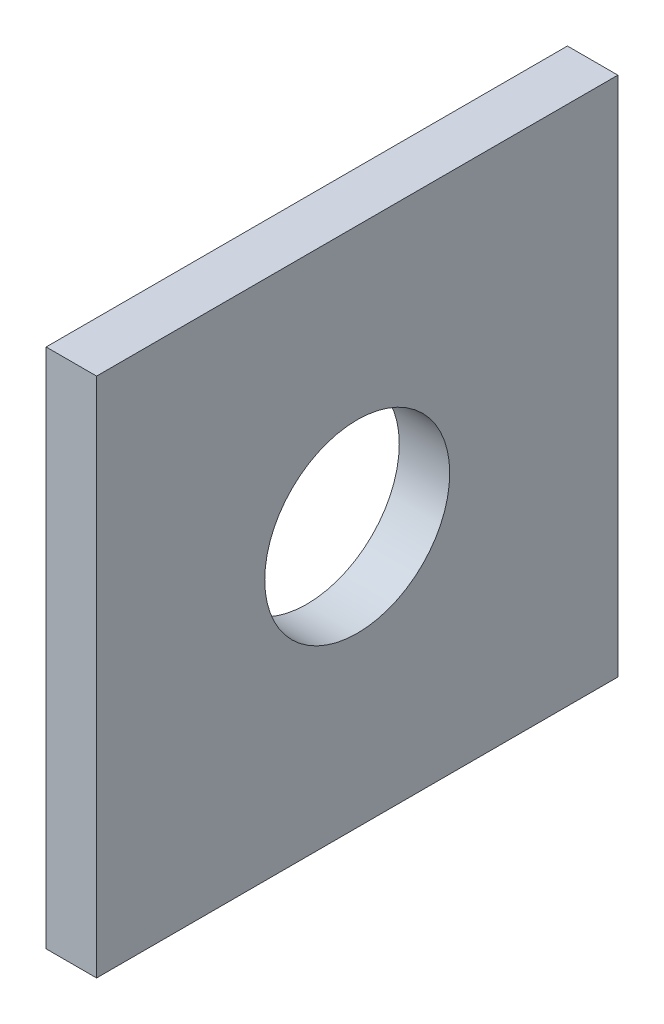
ISO-10303-21;
HEADER;
FILE_DESCRIPTION(('STEP AP214'),'2;1');
FILE_NAME('part.step','',(''),(''),'','','');
FILE_SCHEMA(('AUTOMOTIVE_DESIGN { 1 0 10303 214 1 1 1 1 }'));
ENDSEC;
DATA;
#1=APPLICATION_CONTEXT('core data for automotive mechanical design processes');
#2=APPLICATION_PROTOCOL_DEFINITION('international standard','automotive_design',2000,#1);
#3=PRODUCT_CONTEXT('',#1,'mechanical');
#4=PRODUCT('Part','Part','',(#3));
#5=PRODUCT_RELATED_PRODUCT_CATEGORY('part','',(#4));
#6=PRODUCT_DEFINITION_FORMATION('','',#4);
#7=PRODUCT_DEFINITION_CONTEXT('part definition',#1,'design');
#8=PRODUCT_DEFINITION('design','',#6,#7);
#9=PRODUCT_DEFINITION_SHAPE('','',#8);
#10=(LENGTH_UNIT() NAMED_UNIT(*) SI_UNIT(.MILLI.,.METRE.));
#11=(NAMED_UNIT(*) PLANE_ANGLE_UNIT() SI_UNIT($,.RADIAN.));
#12=(NAMED_UNIT(*) SI_UNIT($,.STERADIAN.) SOLID_ANGLE_UNIT());
#13=UNCERTAINTY_MEASURE_WITH_UNIT(LENGTH_MEASURE(1.E-05),#10,'distance_accuracy_value','');
#14=(GEOMETRIC_REPRESENTATION_CONTEXT(3) GLOBAL_UNCERTAINTY_ASSIGNED_CONTEXT((#13)) GLOBAL_UNIT_ASSIGNED_CONTEXT((#10,
#11,#12)) REPRESENTATION_CONTEXT('',''));
#15=CARTESIAN_POINT('',(0.,0.,0.));
#16=DIRECTION('',(0.,0.,1.));
#17=DIRECTION('',(1.,0.,0.));
#18=AXIS2_PLACEMENT_3D('',#15,#16,#17);
#19=CARTESIAN_POINT('',(-6.,-31.,31.));
#20=DIRECTION('',(0.,0.,1.));
#21=DIRECTION('',(0.,-1.,0.));
#22=AXIS2_PLACEMENT_3D('',#19,#20,#21);
#23=PLANE('',#22);
#24=DIRECTION('',(0.,-1.,0.));
#25=VECTOR('',#24,1.);
#26=CARTESIAN_POINT('',(0.,-31.,31.));
#27=LINE('',#26,#25);
#28=CARTESIAN_POINT('',(0.,31.,31.));
#29=VERTEX_POINT('',#28);
#30=CARTESIAN_POINT('',(0.,-31.,31.));
#31=VERTEX_POINT('',#30);
#32=EDGE_CURVE('E104',#29,#31,#27,.T.);
#33=ORIENTED_EDGE('',*,*,#32,.F.);
#34=DIRECTION('',(1.,0.,0.));
#35=VECTOR('',#34,1.);
#36=CARTESIAN_POINT('',(-6.,31.,31.));
#37=LINE('',#36,#35);
#38=CARTESIAN_POINT('',(-6.,31.,31.));
#39=VERTEX_POINT('',#38);
#40=EDGE_CURVE('E11',#39,#29,#37,.T.);
#41=ORIENTED_EDGE('',*,*,#40,.F.);
#42=DIRECTION('',(0.,-1.,0.));
#43=VECTOR('',#42,1.);
#44=CARTESIAN_POINT('',(-6.,-31.,31.));
#45=LINE('',#44,#43);
#46=CARTESIAN_POINT('',(-6.,-31.,31.));
#47=VERTEX_POINT('',#46);
#48=EDGE_CURVE('E97',#39,#47,#45,.T.);
#49=ORIENTED_EDGE('',*,*,#48,.T.);
#50=DIRECTION('',(1.,0.,0.));
#51=VECTOR('',#50,1.);
#52=CARTESIAN_POINT('',(-6.,-31.,31.));
#53=LINE('',#52,#51);
#54=EDGE_CURVE('E45',#47,#31,#53,.T.);
#55=ORIENTED_EDGE('',*,*,#54,.T.);
#56=EDGE_LOOP('',(#33,#41,#49,#55));
#57=FACE_BOUND('',#56,.T.);
#58=ADVANCED_FACE('F39',(#57),#23,.T.);
#59=CARTESIAN_POINT('',(-6.,31.,31.));
#60=DIRECTION('',(0.,1.,0.));
#61=DIRECTION('',(0.,0.,1.));
#62=AXIS2_PLACEMENT_3D('',#59,#60,#61);
#63=PLANE('',#62);
#64=DIRECTION('',(0.,0.,1.));
#65=VECTOR('',#64,1.);
#66=CARTESIAN_POINT('',(0.,31.,31.));
#67=LINE('',#66,#65);
#68=CARTESIAN_POINT('',(0.,31.,-31.));
#69=VERTEX_POINT('',#68);
#70=EDGE_CURVE('E100',#69,#29,#67,.T.);
#71=ORIENTED_EDGE('',*,*,#70,.F.);
#72=DIRECTION('',(1.,0.,0.));
#73=VECTOR('',#72,1.);
#74=CARTESIAN_POINT('',(-6.,31.,-31.));
#75=LINE('',#74,#73);
#76=CARTESIAN_POINT('',(-6.,31.,-31.));
#77=VERTEX_POINT('',#76);
#78=EDGE_CURVE('E48',#77,#69,#75,.T.);
#79=ORIENTED_EDGE('',*,*,#78,.F.);
#80=DIRECTION('',(0.,0.,1.));
#81=VECTOR('',#80,1.);
#82=CARTESIAN_POINT('',(-6.,31.,31.));
#83=LINE('',#82,#81);
#84=EDGE_CURVE('E91',#77,#39,#83,.T.);
#85=ORIENTED_EDGE('',*,*,#84,.T.);
#86=ORIENTED_EDGE('',*,*,#40,.T.);
#87=EDGE_LOOP('',(#71,#79,#85,#86));
#88=FACE_BOUND('',#87,.T.);
#89=ADVANCED_FACE('F114',(#88),#63,.T.);
#90=CARTESIAN_POINT('',(-6.,-31.,-31.));
#91=DIRECTION('',(0.,0.,-1.));
#92=DIRECTION('',(0.,1.,0.));
#93=AXIS2_PLACEMENT_3D('',#90,#91,#92);
#94=PLANE('',#93);
#95=DIRECTION('',(0.,1.,0.));
#96=VECTOR('',#95,1.);
#97=CARTESIAN_POINT('',(0.,-31.,-31.));
#98=LINE('',#97,#96);
#99=CARTESIAN_POINT('',(0.,-31.,-31.));
#100=VERTEX_POINT('',#99);
#101=EDGE_CURVE('E90',#100,#69,#98,.T.);
#102=ORIENTED_EDGE('',*,*,#101,.F.);
#103=DIRECTION('',(1.,0.,0.));
#104=VECTOR('',#103,1.);
#105=CARTESIAN_POINT('',(-6.,-31.,-31.));
#106=LINE('',#105,#104);
#107=CARTESIAN_POINT('',(-6.,-31.,-31.));
#108=VERTEX_POINT('',#107);
#109=EDGE_CURVE('E81',#108,#100,#106,.T.);
#110=ORIENTED_EDGE('',*,*,#109,.F.);
#111=DIRECTION('',(0.,1.,0.));
#112=VECTOR('',#111,1.);
#113=CARTESIAN_POINT('',(-6.,-31.,-31.));
#114=LINE('',#113,#112);
#115=EDGE_CURVE('E89',#108,#77,#114,.T.);
#116=ORIENTED_EDGE('',*,*,#115,.T.);
#117=ORIENTED_EDGE('',*,*,#78,.T.);
#118=EDGE_LOOP('',(#102,#110,#116,#117));
#119=FACE_BOUND('',#118,.T.);
#120=ADVANCED_FACE('F88',(#119),#94,.T.);
#121=CARTESIAN_POINT('',(-6.,-31.,31.));
#122=DIRECTION('',(0.,-1.,0.));
#123=DIRECTION('',(0.,0.,-1.));
#124=AXIS2_PLACEMENT_3D('',#121,#122,#123);
#125=PLANE('',#124);
#126=DIRECTION('',(0.,0.,-1.));
#127=VECTOR('',#126,1.);
#128=CARTESIAN_POINT('',(0.,-31.,31.));
#129=LINE('',#128,#127);
#130=EDGE_CURVE('E110',#31,#100,#129,.T.);
#131=ORIENTED_EDGE('',*,*,#130,.F.);
#132=ORIENTED_EDGE('',*,*,#54,.F.);
#133=DIRECTION('',(0.,0.,-1.));
#134=VECTOR('',#133,1.);
#135=CARTESIAN_POINT('',(-6.,-31.,31.));
#136=LINE('',#135,#134);
#137=EDGE_CURVE('E95',#47,#108,#136,.T.);
#138=ORIENTED_EDGE('',*,*,#137,.T.);
#139=ORIENTED_EDGE('',*,*,#109,.T.);
#140=EDGE_LOOP('',(#131,#132,#138,#139));
#141=FACE_BOUND('',#140,.T.);
#142=ADVANCED_FACE('F98',(#141),#125,.T.);
#143=CARTESIAN_POINT('',(-6.,31.,31.));
#144=DIRECTION('',(-1.,0.,0.));
#145=DIRECTION('',(0.,0.,1.));
#146=AXIS2_PLACEMENT_3D('',#143,#144,#145);
#147=PLANE('',#146);
#148=CARTESIAN_POINT('',(-6.,0.,0.));
#149=DIRECTION('',(1.,0.,0.));
#150=DIRECTION('',(0.,0.,-1.));
#151=AXIS2_PLACEMENT_3D('',#148,#149,#150);
#152=CIRCLE('',#151,11.);
#153=CARTESIAN_POINT('',(-6.,0.,-11.));
#154=VERTEX_POINT('',#153);
#155=EDGE_CURVE('E108',#154,#154,#152,.T.);
#156=ORIENTED_EDGE('',*,*,#155,.T.);
#157=EDGE_LOOP('',(#156));
#158=FACE_BOUND('',#157,.T.);
#159=ORIENTED_EDGE('',*,*,#48,.F.);
#160=ORIENTED_EDGE('',*,*,#84,.F.);
#161=ORIENTED_EDGE('',*,*,#115,.F.);
#162=ORIENTED_EDGE('',*,*,#137,.F.);
#163=EDGE_LOOP('',(#159,#160,#161,#162));
#164=FACE_BOUND('',#163,.T.);
#165=ADVANCED_FACE('F94',(#158,#164),#147,.T.);
#166=CARTESIAN_POINT('',(0.,31.,31.));
#167=DIRECTION('',(-1.,0.,0.));
#168=DIRECTION('',(0.,0.,1.));
#169=AXIS2_PLACEMENT_3D('',#166,#167,#168);
#170=PLANE('',#169);
#171=CARTESIAN_POINT('',(0.,0.,0.));
#172=DIRECTION('',(1.,0.,0.));
#173=DIRECTION('',(0.,0.,-1.));
#174=AXIS2_PLACEMENT_3D('',#171,#172,#173);
#175=CIRCLE('',#174,11.);
#176=CARTESIAN_POINT('',(0.,0.,-11.));
#177=VERTEX_POINT('',#176);
#178=EDGE_CURVE('E143',#177,#177,#175,.T.);
#179=ORIENTED_EDGE('',*,*,#178,.F.);
#180=EDGE_LOOP('',(#179));
#181=FACE_BOUND('',#180,.T.);
#182=ORIENTED_EDGE('',*,*,#32,.T.);
#183=ORIENTED_EDGE('',*,*,#130,.T.);
#184=ORIENTED_EDGE('',*,*,#101,.T.);
#185=ORIENTED_EDGE('',*,*,#70,.T.);
#186=EDGE_LOOP('',(#182,#183,#184,#185));
#187=FACE_BOUND('',#186,.T.);
#188=ADVANCED_FACE('F112',(#181,#187),#170,.F.);
#189=CARTESIAN_POINT('',(-6.,0.,0.));
#190=DIRECTION('',(1.,0.,0.));
#191=DIRECTION('',(0.,0.,-1.));
#192=AXIS2_PLACEMENT_3D('',#189,#190,#191);
#193=CYLINDRICAL_SURFACE('',#192,11.);
#194=ORIENTED_EDGE('',*,*,#155,.F.);
#195=EDGE_LOOP('',(#194));
#196=FACE_BOUND('',#195,.T.);
#197=ORIENTED_EDGE('',*,*,#178,.T.);
#198=EDGE_LOOP('',(#197));
#199=FACE_BOUND('',#198,.T.);
#200=ADVANCED_FACE('F132',(#196,#199),#193,.F.);
#201=CLOSED_SHELL('',(#58,#89,#120,#142,#165,#188,#200));
#202=MANIFOLD_SOLID_BREP('B2',#201);
#203=ADVANCED_BREP_SHAPE_REPRESENTATION('',(#18,#202),#14);
#204=SHAPE_DEFINITION_REPRESENTATION(#9,#203);
ENDSEC;
END-ISO-10303-21;
